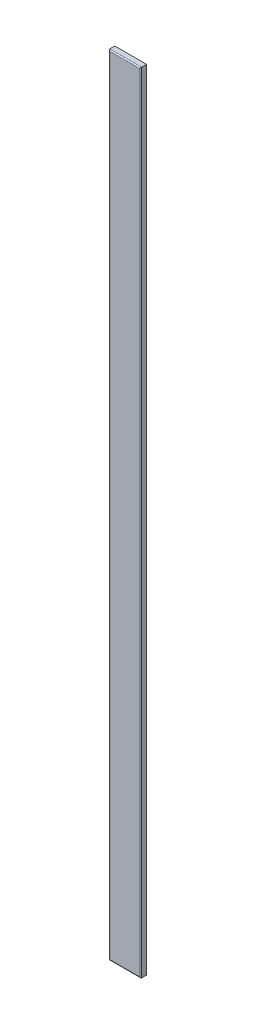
from build123d import *

# Parameters (mm, degrees)
SKETCH_1_W      = 85
SKETCH_1_H      = 2109.6
EXTRUDE_1_DEPTH = 16
FILLET_1_R      = 3


with BuildPart() as part:
    # Sketch 1 → Extrude 1 (new body)
    with BuildSketch(Plane.XY):
        with Locations((484.6, 35)):
            Rectangle(SKETCH_1_W, SKETCH_1_H)
    extrude(amount=EXTRUDE_1_DEPTH)

    # Fillet 1
    fillet_1_edges = [part.edges().sort_by_distance(p)[0] for p in [
        (527.1, 35, 16),
        (484.6, 1089.8, 16),
        (442.1, 35, 16),
        (484.6, -1019.8, 16),
    ]]
    fillet(fillet_1_edges, radius=FILLET_1_R)


solid = part.part
